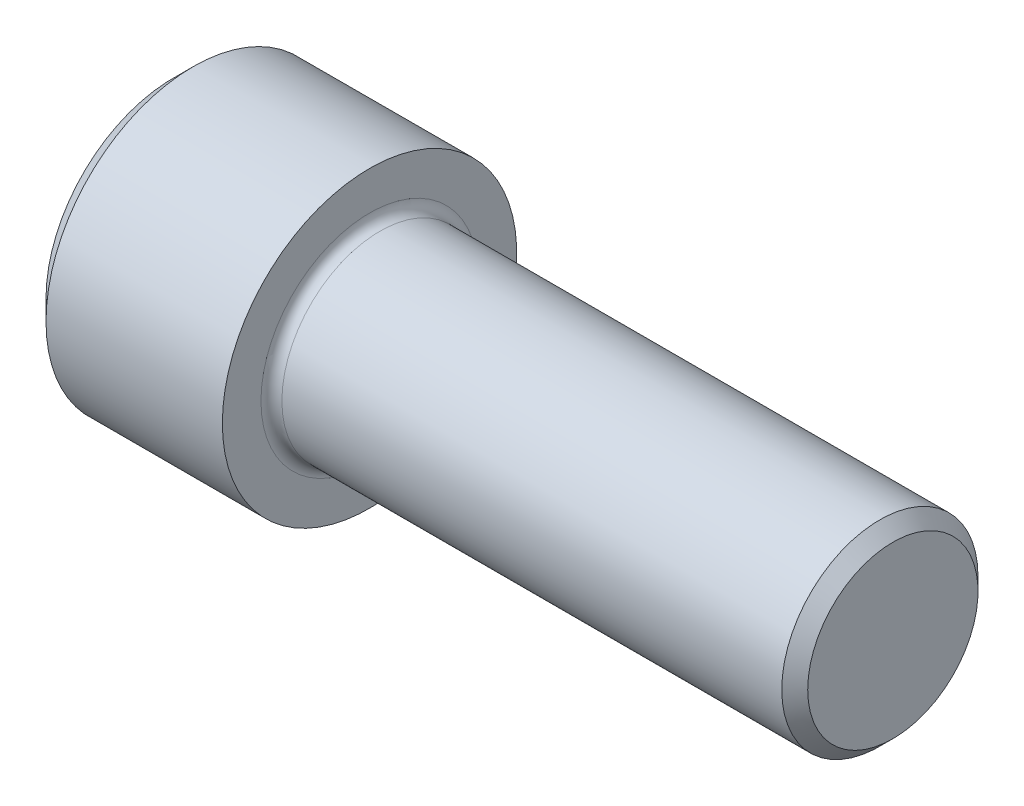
ISO-10303-21;
HEADER;
FILE_DESCRIPTION(('STEP AP214'),'2;1');
FILE_NAME('part.step','',(''),(''),'','','');
FILE_SCHEMA(('AUTOMOTIVE_DESIGN { 1 0 10303 214 1 1 1 1 }'));
ENDSEC;
DATA;
#1=APPLICATION_CONTEXT('core data for automotive mechanical design processes');
#2=APPLICATION_PROTOCOL_DEFINITION('international standard','automotive_design',2000,#1);
#3=PRODUCT_CONTEXT('',#1,'mechanical');
#4=PRODUCT('Part','Part','',(#3));
#5=PRODUCT_RELATED_PRODUCT_CATEGORY('part','',(#4));
#6=PRODUCT_DEFINITION_FORMATION('','',#4);
#7=PRODUCT_DEFINITION_CONTEXT('part definition',#1,'design');
#8=PRODUCT_DEFINITION('design','',#6,#7);
#9=PRODUCT_DEFINITION_SHAPE('','',#8);
#10=(LENGTH_UNIT() NAMED_UNIT(*) SI_UNIT(.MILLI.,.METRE.));
#11=(NAMED_UNIT(*) PLANE_ANGLE_UNIT() SI_UNIT($,.RADIAN.));
#12=(NAMED_UNIT(*) SI_UNIT($,.STERADIAN.) SOLID_ANGLE_UNIT());
#13=UNCERTAINTY_MEASURE_WITH_UNIT(LENGTH_MEASURE(1.E-05),#10,'distance_accuracy_value','');
#14=(GEOMETRIC_REPRESENTATION_CONTEXT(3) GLOBAL_UNCERTAINTY_ASSIGNED_CONTEXT((#13)) GLOBAL_UNIT_ASSIGNED_CONTEXT((#10,
#11,#12)) REPRESENTATION_CONTEXT('',''));
#15=CARTESIAN_POINT('',(0.,0.,0.));
#16=DIRECTION('',(0.,0.,1.));
#17=DIRECTION('',(1.,0.,0.));
#18=AXIS2_PLACEMENT_3D('',#15,#16,#17);
#19=CARTESIAN_POINT('',(4.62279999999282,0.,0.));
#20=DIRECTION('',(-1.,0.,0.));
#21=DIRECTION('',(0.,0.,1.));
#22=AXIS2_PLACEMENT_3D('',#19,#20,#21);
#23=CONICAL_SURFACE('',#22,3.96874999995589,1.0471975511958);
#24=CARTESIAN_POINT('',(6.91415888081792,0.,1.13686837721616E-10));
#25=VERTEX_POINT('',#24);
#26=VERTEX_LOOP('',#25);
#27=FACE_BOUND('',#26,.T.);
#28=CARTESIAN_POINT('',(4.62279999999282,0.,0.));
#29=DIRECTION('',(-1.,0.,0.));
#30=DIRECTION('',(0.,0.,1.));
#31=AXIS2_PLACEMENT_3D('',#28,#29,#30);
#32=CIRCLE('',#31,3.96874999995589);
#33=CARTESIAN_POINT('',(4.62279999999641,-3.43703832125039,1.98437499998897));
#34=VERTEX_POINT('',#33);
#35=CARTESIAN_POINT('',(4.62279999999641,0.,3.96874999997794));
#36=VERTEX_POINT('',#35);
#37=EDGE_CURVE('E96',#34,#36,#32,.T.);
#38=ORIENTED_EDGE('',*,*,#37,.T.);
#39=CARTESIAN_POINT('',(4.62279999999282,0.,0.));
#40=DIRECTION('',(-1.,0.,0.));
#41=DIRECTION('',(0.,0.,1.));
#42=AXIS2_PLACEMENT_3D('',#39,#40,#41);
#43=CIRCLE('',#42,3.96874999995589);
#44=CARTESIAN_POINT('',(4.62279999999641,3.43703832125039,1.98437499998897));
#45=VERTEX_POINT('',#44);
#46=EDGE_CURVE('E99',#36,#45,#43,.T.);
#47=ORIENTED_EDGE('',*,*,#46,.T.);
#48=CARTESIAN_POINT('',(4.62279999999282,0.,0.));
#49=DIRECTION('',(-1.,0.,0.));
#50=DIRECTION('',(0.,0.,1.));
#51=AXIS2_PLACEMENT_3D('',#48,#49,#50);
#52=CIRCLE('',#51,3.96874999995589);
#53=CARTESIAN_POINT('',(4.62279999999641,3.43703832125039,-1.98437499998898));
#54=VERTEX_POINT('',#53);
#55=EDGE_CURVE('E101',#45,#54,#52,.T.);
#56=ORIENTED_EDGE('',*,*,#55,.T.);
#57=CARTESIAN_POINT('',(4.62279999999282,0.,0.));
#58=DIRECTION('',(-1.,0.,0.));
#59=DIRECTION('',(0.,0.,1.));
#60=AXIS2_PLACEMENT_3D('',#57,#58,#59);
#61=CIRCLE('',#60,3.96874999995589);
#62=CARTESIAN_POINT('',(4.62279999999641,0.,-3.96874999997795));
#63=VERTEX_POINT('',#62);
#64=EDGE_CURVE('E115',#54,#63,#61,.T.);
#65=ORIENTED_EDGE('',*,*,#64,.T.);
#66=CARTESIAN_POINT('',(4.62279999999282,0.,0.));
#67=DIRECTION('',(-1.,0.,0.));
#68=DIRECTION('',(0.,0.,1.));
#69=AXIS2_PLACEMENT_3D('',#66,#67,#68);
#70=CIRCLE('',#69,3.96874999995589);
#71=CARTESIAN_POINT('',(4.62279999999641,-3.43703832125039,-1.98437499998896));
#72=VERTEX_POINT('',#71);
#73=EDGE_CURVE('E116',#63,#72,#70,.T.);
#74=ORIENTED_EDGE('',*,*,#73,.T.);
#75=CARTESIAN_POINT('',(4.62279999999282,0.,0.));
#76=DIRECTION('',(-1.,0.,0.));
#77=DIRECTION('',(0.,0.,1.));
#78=AXIS2_PLACEMENT_3D('',#75,#76,#77);
#79=CIRCLE('',#78,3.96874999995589);
#80=EDGE_CURVE('E226',#72,#34,#79,.T.);
#81=ORIENTED_EDGE('',*,*,#80,.T.);
#82=EDGE_LOOP('',(#38,#47,#56,#65,#74,#81));
#83=FACE_BOUND('',#82,.T.);
#84=ADVANCED_FACE('F17',(#27,#83),#23,.F.);
#85=CARTESIAN_POINT('',(4.6228,6.87407664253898,-3.96875000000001));
#86=DIRECTION('',(1.,0.,0.));
#87=DIRECTION('',(0.,0.,-1.));
#88=AXIS2_PLACEMENT_3D('',#85,#86,#87);
#89=PLANE('',#88);
#90=DIRECTION('',(0.,0.499999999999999,-0.86602540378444));
#91=VECTOR('',#90,1.);
#92=CARTESIAN_POINT('',(4.6228,4.58271776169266,0.));
#93=LINE('',#92,#91);
#94=CARTESIAN_POINT('',(4.6228,2.29135888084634,3.96874999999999));
#95=VERTEX_POINT('',#94);
#96=EDGE_CURVE('E119',#45,#95,#93,.F.);
#97=ORIENTED_EDGE('',*,*,#96,.F.);
#98=ORIENTED_EDGE('',*,*,#46,.F.);
#99=DIRECTION('',(0.,-1.,0.));
#100=VECTOR('',#99,1.);
#101=CARTESIAN_POINT('',(4.6228,-2.29135888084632,3.96875));
#102=LINE('',#101,#100);
#103=EDGE_CURVE('E121',#36,#95,#102,.F.);
#104=ORIENTED_EDGE('',*,*,#103,.T.);
#105=EDGE_LOOP('',(#97,#98,#104));
#106=FACE_BOUND('',#105,.T.);
#107=ADVANCED_FACE('F120',(#106),#89,.F.);
#108=CARTESIAN_POINT('',(4.6228,6.87407664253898,-3.96875000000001));
#109=DIRECTION('',(1.,0.,0.));
#110=DIRECTION('',(0.,0.,-1.));
#111=AXIS2_PLACEMENT_3D('',#108,#109,#110);
#112=PLANE('',#111);
#113=DIRECTION('',(0.,-1.,0.));
#114=VECTOR('',#113,1.);
#115=CARTESIAN_POINT('',(4.6228,-2.29135888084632,3.96875));
#116=LINE('',#115,#114);
#117=CARTESIAN_POINT('',(4.6228,-2.29135888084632,3.96875));
#118=VERTEX_POINT('',#117);
#119=EDGE_CURVE('E124',#118,#36,#116,.F.);
#120=ORIENTED_EDGE('',*,*,#119,.T.);
#121=ORIENTED_EDGE('',*,*,#37,.F.);
#122=DIRECTION('',(0.,0.500000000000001,0.866025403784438));
#123=VECTOR('',#122,1.);
#124=CARTESIAN_POINT('',(4.6228,-2.29135888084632,3.96875));
#125=LINE('',#124,#123);
#126=EDGE_CURVE('E177',#118,#34,#125,.F.);
#127=ORIENTED_EDGE('',*,*,#126,.F.);
#128=EDGE_LOOP('',(#120,#121,#127));
#129=FACE_BOUND('',#128,.T.);
#130=ADVANCED_FACE('F346',(#129),#112,.F.);
#131=CARTESIAN_POINT('',(4.6228,6.87407664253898,-3.96875000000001));
#132=DIRECTION('',(1.,0.,0.));
#133=DIRECTION('',(0.,0.,-1.));
#134=AXIS2_PLACEMENT_3D('',#131,#132,#133);
#135=PLANE('',#134);
#136=DIRECTION('',(0.,0.500000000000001,0.866025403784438));
#137=VECTOR('',#136,1.);
#138=CARTESIAN_POINT('',(4.6228,-2.29135888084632,3.96875));
#139=LINE('',#138,#137);
#140=CARTESIAN_POINT('',(4.6228,-4.58271776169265,0.));
#141=VERTEX_POINT('',#140);
#142=EDGE_CURVE('E173',#34,#141,#139,.F.);
#143=ORIENTED_EDGE('',*,*,#142,.F.);
#144=ORIENTED_EDGE('',*,*,#80,.F.);
#145=DIRECTION('',(0.,-0.499999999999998,0.86602540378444));
#146=VECTOR('',#145,1.);
#147=CARTESIAN_POINT('',(4.6228,-4.58271776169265,0.));
#148=LINE('',#147,#146);
#149=EDGE_CURVE('E160',#141,#72,#148,.F.);
#150=ORIENTED_EDGE('',*,*,#149,.F.);
#151=EDGE_LOOP('',(#143,#144,#150));
#152=FACE_BOUND('',#151,.T.);
#153=ADVANCED_FACE('F342',(#152),#135,.F.);
#154=CARTESIAN_POINT('',(4.6228,6.87407664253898,-3.96875000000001));
#155=DIRECTION('',(1.,0.,0.));
#156=DIRECTION('',(0.,0.,-1.));
#157=AXIS2_PLACEMENT_3D('',#154,#155,#156);
#158=PLANE('',#157);
#159=DIRECTION('',(0.,-0.499999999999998,0.86602540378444));
#160=VECTOR('',#159,1.);
#161=CARTESIAN_POINT('',(4.6228,-4.58271776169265,0.));
#162=LINE('',#161,#160);
#163=CARTESIAN_POINT('',(4.6228,-2.29135888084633,-3.96875));
#164=VERTEX_POINT('',#163);
#165=EDGE_CURVE('E157',#72,#164,#162,.F.);
#166=ORIENTED_EDGE('',*,*,#165,.F.);
#167=ORIENTED_EDGE('',*,*,#73,.F.);
#168=DIRECTION('',(0.,1.,0.));
#169=VECTOR('',#168,1.);
#170=CARTESIAN_POINT('',(4.6228,2.29135888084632,-3.96875));
#171=LINE('',#170,#169);
#172=EDGE_CURVE('E151',#63,#164,#171,.F.);
#173=ORIENTED_EDGE('',*,*,#172,.T.);
#174=EDGE_LOOP('',(#166,#167,#173));
#175=FACE_BOUND('',#174,.T.);
#176=ADVANCED_FACE('F339',(#175),#158,.F.);
#177=CARTESIAN_POINT('',(4.6228,6.87407664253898,-3.96875000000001));
#178=DIRECTION('',(1.,0.,0.));
#179=DIRECTION('',(0.,0.,-1.));
#180=AXIS2_PLACEMENT_3D('',#177,#178,#179);
#181=PLANE('',#180);
#182=DIRECTION('',(0.,0.500000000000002,0.866025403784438));
#183=VECTOR('',#182,1.);
#184=CARTESIAN_POINT('',(4.6228,4.58271776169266,0.));
#185=LINE('',#184,#183);
#186=CARTESIAN_POINT('',(4.6228,4.58271776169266,0.));
#187=VERTEX_POINT('',#186);
#188=EDGE_CURVE('E113',#187,#54,#185,.F.);
#189=ORIENTED_EDGE('',*,*,#188,.T.);
#190=ORIENTED_EDGE('',*,*,#55,.F.);
#191=DIRECTION('',(0.,0.499999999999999,-0.86602540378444));
#192=VECTOR('',#191,1.);
#193=CARTESIAN_POINT('',(4.6228,4.58271776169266,0.));
#194=LINE('',#193,#192);
#195=EDGE_CURVE('E110',#187,#45,#194,.F.);
#196=ORIENTED_EDGE('',*,*,#195,.F.);
#197=EDGE_LOOP('',(#189,#190,#196));
#198=FACE_BOUND('',#197,.T.);
#199=ADVANCED_FACE('F108',(#198),#181,.F.);
#200=CARTESIAN_POINT('',(4.6228,6.87407664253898,-3.96875000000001));
#201=DIRECTION('',(1.,0.,0.));
#202=DIRECTION('',(0.,0.,-1.));
#203=AXIS2_PLACEMENT_3D('',#200,#201,#202);
#204=PLANE('',#203);
#205=DIRECTION('',(0.,1.,0.));
#206=VECTOR('',#205,1.);
#207=CARTESIAN_POINT('',(4.6228,2.29135888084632,-3.96875));
#208=LINE('',#207,#206);
#209=CARTESIAN_POINT('',(4.6228,2.29135888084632,-3.96875));
#210=VERTEX_POINT('',#209);
#211=EDGE_CURVE('E154',#210,#63,#208,.F.);
#212=ORIENTED_EDGE('',*,*,#211,.T.);
#213=ORIENTED_EDGE('',*,*,#64,.F.);
#214=DIRECTION('',(0.,0.500000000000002,0.866025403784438));
#215=VECTOR('',#214,1.);
#216=CARTESIAN_POINT('',(4.6228,4.58271776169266,0.));
#217=LINE('',#216,#215);
#218=EDGE_CURVE('E494',#54,#210,#217,.F.);
#219=ORIENTED_EDGE('',*,*,#218,.T.);
#220=EDGE_LOOP('',(#212,#213,#219));
#221=FACE_BOUND('',#220,.T.);
#222=ADVANCED_FACE('F333',(#221),#204,.F.);
#223=CARTESIAN_POINT('',(4.6228,4.58271776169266,0.));
#224=DIRECTION('',(0.,-0.86602540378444,-0.499999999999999));
#225=DIRECTION('',(0.,0.499999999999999,-0.86602540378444));
#226=AXIS2_PLACEMENT_3D('',#223,#224,#225);
#227=PLANE('',#226);
#228=ORIENTED_EDGE('',*,*,#96,.T.);
#229=DIRECTION('',(1.,0.,0.));
#230=VECTOR('',#229,1.);
#231=CARTESIAN_POINT('',(4.6228,2.29135888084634,3.96874999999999));
#232=LINE('',#231,#230);
#233=CARTESIAN_POINT('',(0.,2.29135888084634,3.96874999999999));
#234=VERTEX_POINT('',#233);
#235=EDGE_CURVE('E197',#95,#234,#232,.F.);
#236=ORIENTED_EDGE('',*,*,#235,.T.);
#237=DIRECTION('',(0.,-0.499999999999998,0.866025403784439));
#238=VECTOR('',#237,1.);
#239=CARTESIAN_POINT('',(0.,4.58271776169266,0.));
#240=LINE('',#239,#238);
#241=CARTESIAN_POINT('',(0.,4.58271776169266,0.));
#242=VERTEX_POINT('',#241);
#243=EDGE_CURVE('E137',#242,#234,#240,.T.);
#244=ORIENTED_EDGE('',*,*,#243,.F.);
#245=DIRECTION('',(1.,0.,0.));
#246=VECTOR('',#245,1.);
#247=CARTESIAN_POINT('',(4.6228,4.58271776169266,0.));
#248=LINE('',#247,#246);
#249=EDGE_CURVE('E128',#242,#187,#248,.T.);
#250=ORIENTED_EDGE('',*,*,#249,.T.);
#251=ORIENTED_EDGE('',*,*,#195,.T.);
#252=EDGE_LOOP('',(#228,#236,#244,#250,#251));
#253=FACE_BOUND('',#252,.T.);
#254=ADVANCED_FACE('F126',(#253),#227,.T.);
#255=CARTESIAN_POINT('',(4.6228,-2.29135888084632,3.96875));
#256=DIRECTION('',(0.,0.,1.));
#257=DIRECTION('',(0.,-1.,0.));
#258=AXIS2_PLACEMENT_3D('',#255,#256,#257);
#259=PLANE('',#258);
#260=ORIENTED_EDGE('',*,*,#235,.F.);
#261=ORIENTED_EDGE('',*,*,#103,.F.);
#262=ORIENTED_EDGE('',*,*,#119,.F.);
#263=DIRECTION('',(1.,0.,0.));
#264=VECTOR('',#263,1.);
#265=CARTESIAN_POINT('',(4.6228,-2.29135888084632,3.96875));
#266=LINE('',#265,#264);
#267=CARTESIAN_POINT('',(0.,-2.29135888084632,3.96875));
#268=VERTEX_POINT('',#267);
#269=EDGE_CURVE('E192',#268,#118,#266,.T.);
#270=ORIENTED_EDGE('',*,*,#269,.F.);
#271=DIRECTION('',(0.,1.,0.));
#272=VECTOR('',#271,1.);
#273=CARTESIAN_POINT('',(0.,0.,3.96874999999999));
#274=LINE('',#273,#272);
#275=EDGE_CURVE('E140',#234,#268,#274,.F.);
#276=ORIENTED_EDGE('',*,*,#275,.F.);
#277=EDGE_LOOP('',(#260,#261,#262,#270,#276));
#278=FACE_BOUND('',#277,.T.);
#279=ADVANCED_FACE('F326',(#278),#259,.F.);
#280=CARTESIAN_POINT('',(4.6228,-2.29135888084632,3.96875));
#281=DIRECTION('',(0.,0.866025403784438,-0.500000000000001));
#282=DIRECTION('',(0.,0.500000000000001,0.866025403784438));
#283=AXIS2_PLACEMENT_3D('',#280,#281,#282);
#284=PLANE('',#283);
#285=ORIENTED_EDGE('',*,*,#142,.T.);
#286=DIRECTION('',(1.,0.,0.));
#287=VECTOR('',#286,1.);
#288=CARTESIAN_POINT('',(4.6228,-4.58271776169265,0.));
#289=LINE('',#288,#287);
#290=CARTESIAN_POINT('',(0.,-4.58271776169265,0.));
#291=VERTEX_POINT('',#290);
#292=EDGE_CURVE('E168',#291,#141,#289,.T.);
#293=ORIENTED_EDGE('',*,*,#292,.F.);
#294=DIRECTION('',(0.,-0.500000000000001,-0.866025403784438));
#295=VECTOR('',#294,1.);
#296=CARTESIAN_POINT('',(0.,-2.29135888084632,3.96875));
#297=LINE('',#296,#295);
#298=EDGE_CURVE('E183',#268,#291,#297,.T.);
#299=ORIENTED_EDGE('',*,*,#298,.F.);
#300=ORIENTED_EDGE('',*,*,#269,.T.);
#301=ORIENTED_EDGE('',*,*,#126,.T.);
#302=EDGE_LOOP('',(#285,#293,#299,#300,#301));
#303=FACE_BOUND('',#302,.T.);
#304=ADVANCED_FACE('F322',(#303),#284,.T.);
#305=CARTESIAN_POINT('',(4.6228,-4.58271776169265,0.));
#306=DIRECTION('',(0.,0.86602540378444,0.499999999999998));
#307=DIRECTION('',(0.,-0.499999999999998,0.86602540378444));
#308=AXIS2_PLACEMENT_3D('',#305,#306,#307);
#309=PLANE('',#308);
#310=ORIENTED_EDGE('',*,*,#165,.T.);
#311=DIRECTION('',(1.,0.,0.));
#312=VECTOR('',#311,1.);
#313=CARTESIAN_POINT('',(4.6228,-2.29135888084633,-3.96875));
#314=LINE('',#313,#312);
#315=CARTESIAN_POINT('',(0.,-2.29135888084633,-3.96875));
#316=VERTEX_POINT('',#315);
#317=EDGE_CURVE('E153',#164,#316,#314,.F.);
#318=ORIENTED_EDGE('',*,*,#317,.T.);
#319=DIRECTION('',(0.,0.499999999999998,-0.86602540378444));
#320=VECTOR('',#319,1.);
#321=CARTESIAN_POINT('',(0.,-4.58271776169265,0.));
#322=LINE('',#321,#320);
#323=EDGE_CURVE('E180',#291,#316,#322,.T.);
#324=ORIENTED_EDGE('',*,*,#323,.F.);
#325=ORIENTED_EDGE('',*,*,#292,.T.);
#326=ORIENTED_EDGE('',*,*,#149,.T.);
#327=EDGE_LOOP('',(#310,#318,#324,#325,#326));
#328=FACE_BOUND('',#327,.T.);
#329=ADVANCED_FACE('F318',(#328),#309,.T.);
#330=CARTESIAN_POINT('',(4.6228,2.29135888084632,-3.96875));
#331=DIRECTION('',(0.,0.,-1.));
#332=DIRECTION('',(0.,1.,0.));
#333=AXIS2_PLACEMENT_3D('',#330,#331,#332);
#334=PLANE('',#333);
#335=ORIENTED_EDGE('',*,*,#317,.F.);
#336=ORIENTED_EDGE('',*,*,#172,.F.);
#337=ORIENTED_EDGE('',*,*,#211,.F.);
#338=DIRECTION('',(1.,0.,0.));
#339=VECTOR('',#338,1.);
#340=CARTESIAN_POINT('',(4.6228,2.29135888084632,-3.96875));
#341=LINE('',#340,#339);
#342=CARTESIAN_POINT('',(0.,2.29135888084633,-3.96875));
#343=VERTEX_POINT('',#342);
#344=EDGE_CURVE('E141',#210,#343,#341,.F.);
#345=ORIENTED_EDGE('',*,*,#344,.T.);
#346=DIRECTION('',(0.,1.,0.));
#347=VECTOR('',#346,1.);
#348=CARTESIAN_POINT('',(0.,0.,-3.96875));
#349=LINE('',#348,#347);
#350=EDGE_CURVE('E148',#316,#343,#349,.T.);
#351=ORIENTED_EDGE('',*,*,#350,.F.);
#352=EDGE_LOOP('',(#335,#336,#337,#345,#351));
#353=FACE_BOUND('',#352,.T.);
#354=ADVANCED_FACE('F314',(#353),#334,.F.);
#355=CARTESIAN_POINT('',(4.6228,4.58271776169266,0.));
#356=DIRECTION('',(0.,0.866025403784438,-0.500000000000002));
#357=DIRECTION('',(0.,0.500000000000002,0.866025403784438));
#358=AXIS2_PLACEMENT_3D('',#355,#356,#357);
#359=PLANE('',#358);
#360=ORIENTED_EDGE('',*,*,#344,.F.);
#361=ORIENTED_EDGE('',*,*,#218,.F.);
#362=ORIENTED_EDGE('',*,*,#188,.F.);
#363=ORIENTED_EDGE('',*,*,#249,.F.);
#364=DIRECTION('',(0.,0.500000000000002,0.866025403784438));
#365=VECTOR('',#364,1.);
#366=CARTESIAN_POINT('',(0.,2.29135888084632,-3.96875));
#367=LINE('',#366,#365);
#368=EDGE_CURVE('E144',#343,#242,#367,.T.);
#369=ORIENTED_EDGE('',*,*,#368,.F.);
#370=EDGE_LOOP('',(#360,#361,#362,#363,#369));
#371=FACE_BOUND('',#370,.T.);
#372=ADVANCED_FACE('F310',(#371),#359,.F.);
#373=CARTESIAN_POINT('',(0.,0.,0.));
#374=DIRECTION('',(-1.,0.,0.));
#375=DIRECTION('',(0.,0.,1.));
#376=AXIS2_PLACEMENT_3D('',#373,#374,#375);
#377=PLANE('',#376);
#378=CARTESIAN_POINT('',(0.,0.,0.));
#379=DIRECTION('',(1.,0.,0.));
#380=DIRECTION('',(0.,0.,-1.));
#381=AXIS2_PLACEMENT_3D('',#378,#379,#380);
#382=CIRCLE('',#381,6.17855000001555);
#383=CARTESIAN_POINT('',(0.,0.,-6.17855000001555));
#384=VERTEX_POINT('',#383);
#385=EDGE_CURVE('E147',#384,#384,#382,.T.);
#386=ORIENTED_EDGE('',*,*,#385,.F.);
#387=EDGE_LOOP('',(#386));
#388=FACE_BOUND('',#387,.T.);
#389=ORIENTED_EDGE('',*,*,#350,.T.);
#390=ORIENTED_EDGE('',*,*,#368,.T.);
#391=ORIENTED_EDGE('',*,*,#243,.T.);
#392=ORIENTED_EDGE('',*,*,#275,.T.);
#393=ORIENTED_EDGE('',*,*,#298,.T.);
#394=ORIENTED_EDGE('',*,*,#323,.T.);
#395=EDGE_LOOP('',(#389,#390,#391,#392,#393,#394));
#396=FACE_BOUND('',#395,.T.);
#397=ADVANCED_FACE('F302',(#388,#396),#377,.T.);
#398=CARTESIAN_POINT('',(0.965199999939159,0.,0.));
#399=DIRECTION('',(1.,0.,0.));
#400=DIRECTION('',(0.,0.,-1.));
#401=AXIS2_PLACEMENT_3D('',#398,#399,#400);
#402=CONICAL_SURFACE('',#401,7.14374999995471,0.785398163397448);
#403=ORIENTED_EDGE('',*,*,#385,.T.);
#404=EDGE_LOOP('',(#403));
#405=FACE_BOUND('',#404,.T.);
#406=CARTESIAN_POINT('',(0.965199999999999,0.,0.));
#407=DIRECTION('',(-1.,0.,0.));
#408=DIRECTION('',(0.,0.,1.));
#409=AXIS2_PLACEMENT_3D('',#406,#407,#408);
#410=CIRCLE('',#409,7.14375);
#411=CARTESIAN_POINT('',(0.965199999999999,0.,7.14375));
#412=VERTEX_POINT('',#411);
#413=EDGE_CURVE('E222',#412,#412,#410,.F.);
#414=ORIENTED_EDGE('',*,*,#413,.F.);
#415=EDGE_LOOP('',(#414));
#416=FACE_BOUND('',#415,.T.);
#417=ADVANCED_FACE('F297',(#405,#416),#402,.T.);
#418=CARTESIAN_POINT('',(-31.75,0.,0.));
#419=DIRECTION('',(-1.,0.,0.));
#420=DIRECTION('',(0.,0.,1.));
#421=AXIS2_PLACEMENT_3D('',#418,#419,#420);
#422=CYLINDRICAL_SURFACE('',#421,7.14375);
#423=CARTESIAN_POINT('',(9.525,0.,0.));
#424=DIRECTION('',(-1.,0.,0.));
#425=DIRECTION('',(0.,0.,1.));
#426=AXIS2_PLACEMENT_3D('',#423,#424,#425);
#427=CIRCLE('',#426,7.14375);
#428=CARTESIAN_POINT('',(9.525,0.,7.14375));
#429=VERTEX_POINT('',#428);
#430=EDGE_CURVE('E219',#429,#429,#427,.F.);
#431=ORIENTED_EDGE('',*,*,#430,.F.);
#432=EDGE_LOOP('',(#431));
#433=FACE_BOUND('',#432,.T.);
#434=ORIENTED_EDGE('',*,*,#413,.T.);
#435=EDGE_LOOP('',(#434));
#436=FACE_BOUND('',#435,.T.);
#437=ADVANCED_FACE('F293',(#433,#436),#422,.T.);
#438=CARTESIAN_POINT('',(34.925,4.13258,0.));
#439=DIRECTION('',(1.,0.,0.));
#440=DIRECTION('',(0.,0.,-1.));
#441=AXIS2_PLACEMENT_3D('',#438,#439,#440);
#442=PLANE('',#441);
#443=CARTESIAN_POINT('',(34.924999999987,0.,0.));
#444=DIRECTION('',(-1.,0.,0.));
#445=DIRECTION('',(0.,0.,1.));
#446=AXIS2_PLACEMENT_3D('',#443,#444,#445);
#447=CIRCLE('',#446,4.13258000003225);
#448=CARTESIAN_POINT('',(34.924999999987,0.,4.13258000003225));
#449=VERTEX_POINT('',#448);
#450=EDGE_CURVE('E215',#449,#449,#447,.T.);
#451=ORIENTED_EDGE('',*,*,#450,.F.);
#452=EDGE_LOOP('',(#451));
#453=FACE_BOUND('',#452,.T.);
#454=ADVANCED_FACE('F251',(#453),#442,.T.);
#455=CARTESIAN_POINT('',(9.525,7.14375,0.));
#456=DIRECTION('',(1.,0.,0.));
#457=DIRECTION('',(0.,0.,-1.));
#458=AXIS2_PLACEMENT_3D('',#455,#456,#457);
#459=PLANE('',#458);
#460=ORIENTED_EDGE('',*,*,#430,.T.);
#461=EDGE_LOOP('',(#460));
#462=FACE_BOUND('',#461,.T.);
#463=CARTESIAN_POINT('',(9.525,0.,0.));
#464=DIRECTION('',(1.,0.,0.));
#465=DIRECTION('',(0.,0.,1.));
#466=AXIS2_PLACEMENT_3D('',#463,#464,#465);
#467=CIRCLE('',#466,5.27049999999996);
#468=CARTESIAN_POINT('',(9.525,0.,-5.27049999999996));
#469=VERTEX_POINT('',#468);
#470=CARTESIAN_POINT('',(9.525,0.,5.27049999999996));
#471=VERTEX_POINT('',#470);
#472=EDGE_CURVE('E218',#469,#471,#467,.F.);
#473=ORIENTED_EDGE('',*,*,#472,.T.);
#474=CARTESIAN_POINT('',(9.525,0.,0.));
#475=DIRECTION('',(1.,0.,0.));
#476=DIRECTION('',(0.,0.,-1.));
#477=AXIS2_PLACEMENT_3D('',#474,#475,#476);
#478=CIRCLE('',#477,5.27049999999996);
#479=EDGE_CURVE('E36',#471,#469,#478,.F.);
#480=ORIENTED_EDGE('',*,*,#479,.T.);
#481=EDGE_LOOP('',(#473,#480));
#482=FACE_BOUND('',#481,.T.);
#483=ADVANCED_FACE('F232',(#462,#482),#459,.T.);
#484=CARTESIAN_POINT('',(34.2950799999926,0.,0.));
#485=DIRECTION('',(-1.,0.,0.));
#486=DIRECTION('',(0.,0.,1.));
#487=AXIS2_PLACEMENT_3D('',#484,#485,#486);
#488=CONICAL_SURFACE('',#487,4.76250000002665,0.785398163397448);
#489=CARTESIAN_POINT('',(34.2950799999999,0.,0.));
#490=DIRECTION('',(-1.,0.,0.));
#491=DIRECTION('',(0.,0.,1.));
#492=AXIS2_PLACEMENT_3D('',#489,#490,#491);
#493=CIRCLE('',#492,4.76249999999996);
#494=CARTESIAN_POINT('',(34.2950799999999,0.,4.76249999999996));
#495=VERTEX_POINT('',#494);
#496=EDGE_CURVE('E28',#495,#495,#493,.T.);
#497=ORIENTED_EDGE('',*,*,#496,.F.);
#498=EDGE_LOOP('',(#497));
#499=FACE_BOUND('',#498,.T.);
#500=ORIENTED_EDGE('',*,*,#450,.T.);
#501=EDGE_LOOP('',(#500));
#502=FACE_BOUND('',#501,.T.);
#503=ADVANCED_FACE('F250',(#499,#502),#488,.T.);
#504=CARTESIAN_POINT('',(10.033,0.,0.));
#505=DIRECTION('',(1.,0.,0.));
#506=DIRECTION('',(0.,0.,-1.));
#507=AXIS2_PLACEMENT_3D('',#504,#505,#506);
#508=TOROIDAL_SURFACE('',#507,5.27049999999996,0.508);
#509=CARTESIAN_POINT('',(10.033,0.,0.));
#510=DIRECTION('',(-1.,0.,0.));
#511=DIRECTION('',(0.,0.,1.));
#512=AXIS2_PLACEMENT_3D('',#509,#510,#511);
#513=CIRCLE('',#512,4.76249999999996);
#514=CARTESIAN_POINT('',(10.033,0.,4.76249999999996));
#515=VERTEX_POINT('',#514);
#516=EDGE_CURVE('E11',#515,#515,#513,.F.);
#517=ORIENTED_EDGE('',*,*,#516,.F.);
#518=EDGE_LOOP('',(#517));
#519=FACE_BOUND('',#518,.T.);
#520=ORIENTED_EDGE('',*,*,#472,.F.);
#521=ORIENTED_EDGE('',*,*,#479,.F.);
#522=EDGE_LOOP('',(#520,#521));
#523=FACE_BOUND('',#522,.T.);
#524=ADVANCED_FACE('F229',(#519,#523),#508,.F.);
#525=CARTESIAN_POINT('',(-31.75,0.,0.));
#526=DIRECTION('',(-1.,0.,0.));
#527=DIRECTION('',(0.,0.,1.));
#528=AXIS2_PLACEMENT_3D('',#525,#526,#527);
#529=CYLINDRICAL_SURFACE('',#528,4.76249999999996);
#530=ORIENTED_EDGE('',*,*,#516,.T.);
#531=EDGE_LOOP('',(#530));
#532=FACE_BOUND('',#531,.T.);
#533=ORIENTED_EDGE('',*,*,#496,.T.);
#534=EDGE_LOOP('',(#533));
#535=FACE_BOUND('',#534,.T.);
#536=ADVANCED_FACE('F275',(#532,#535),#529,.T.);
#537=CLOSED_SHELL('',(#84,#107,#130,#153,#176,#199,#222,#254,#279,#304,#329,#354,#372,#397,#417,
#437,#454,#483,#503,#524,#536));
#538=MANIFOLD_SOLID_BREP('B1',#537);
#539=ADVANCED_BREP_SHAPE_REPRESENTATION('',(#18,#538),#14);
#540=SHAPE_DEFINITION_REPRESENTATION(#9,#539);
ENDSEC;
END-ISO-10303-21;
